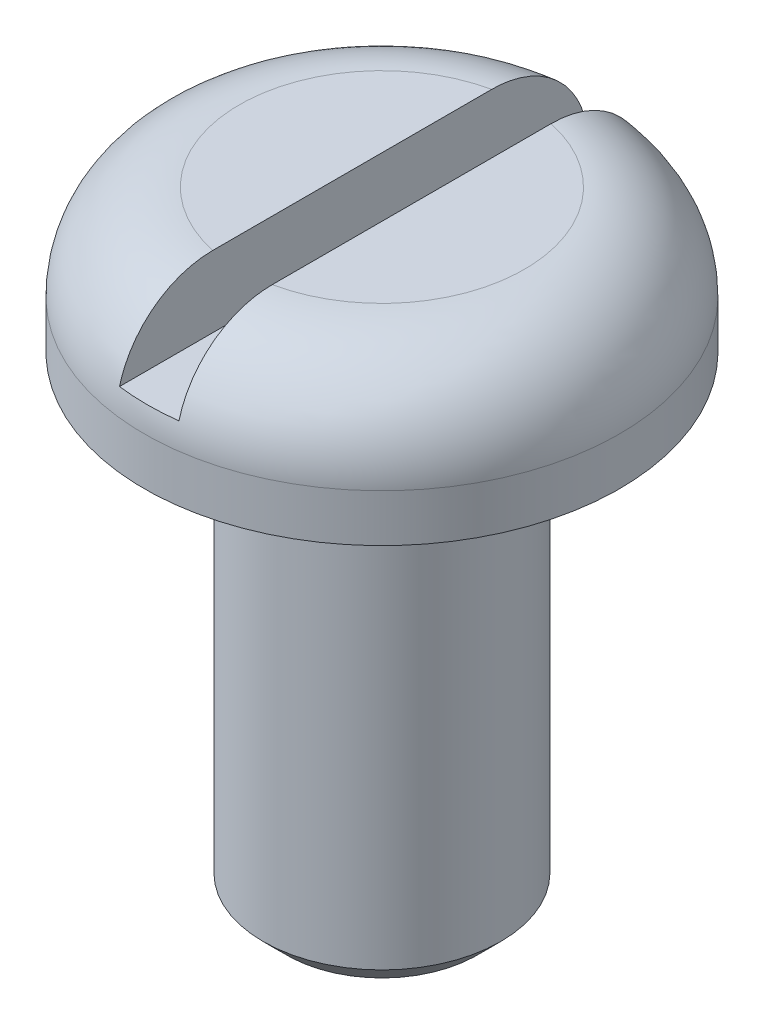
from build123d import *

# Parameters (mm, degrees)
SKETCH2_W           = 0.5
SKETCH2_H           = 5.813461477
CUT_EXTRUDE1_DEPTH  = 0.6
SKETCH3_R           = 1
BOSS_EXTRUDE1_DEPTH = 4
SKETCH4_OUTSIDE_W   = 15.536
SKETCH4_OUTSIDE_H   = 15.536
SKETCH4_OUTSIDE_R   = 0.8
CUT_EXTRUDE2_DEPTH  = 4
CUT_EXTRUDE2_DRAFT  = -45


with BuildPart() as part:
    # Sketch1 → Revolve1 (revolve)
    with BuildSketch(Plane.XY, mode=Mode.PRIVATE) as revolve1_sk:
        with BuildLine():
            Line((0, 0), (0, 1.2))
            Line((0, 1.2), (1.2, 1.2))
            ThreePointArc((1.2, 1.2), (1.765685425, 0.965685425), (2, 0.4))
            Line((2, 0.4), (2, 0))
            Line((2, 0), (0, 0))
        make_face()
    revolve(revolve1_sk.sketch.rotate(Axis((0, 0, 0), (0, 1, 0)), 90), axis=Axis((0, 0, 0), (0, 1, 0)))

    # Sketch2 → Cut-Extrude1 (cut)
    with BuildSketch(Plane(origin=(0, 1.2, 0), x_dir=(1, 0, 0), z_dir=(0, 1, 0))):
        with Locations((0, 0.020232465)):
            Rectangle(SKETCH2_W, SKETCH2_H)
    extrude(amount=-CUT_EXTRUDE1_DEPTH, mode=Mode.SUBTRACT)

    # Sketch3 → Boss-Extrude1 (add)
    with BuildSketch(Plane.XZ):
        with Locations(Location((0, 0, 0), (0, 0, 270))):
            Circle(SKETCH3_R)
    extrude(amount=BOSS_EXTRUDE1_DEPTH)


with BuildPart() as cut_extrude2_tool:
    # Sketch4 outside → Cut-Extrude2 (with draft: the straight prism first)
    with BuildSketch(Plane.XZ.offset(4)):
        Rectangle(SKETCH4_OUTSIDE_W, SKETCH4_OUTSIDE_H)
        Circle(SKETCH4_OUTSIDE_R, mode=Mode.SUBTRACT)
    extrude(amount=-CUT_EXTRUDE2_DEPTH)
    # Cut-Extrude2: the draft: its side faces are tilted about the plane it starts from
    cut_extrude2_sides = [cut_extrude2_tool.faces().sort_by_distance(p)[0] for p in [
        (0, -2, -7.768),
        (7.768, -2, 0),
        (0, -2, 7.768),
        (-7.768, -2, 0),
        (-0.8, -2, 0),
    ]]
    draft(cut_extrude2_sides, Plane.XZ.offset(4), CUT_EXTRUDE2_DRAFT)


with BuildPart() as part_1:
    add(part.part)

    # Cut-Extrude2: cut by cut_extrude2_tool
    add(cut_extrude2_tool.part, mode=Mode.SUBTRACT)


solid = part_1.part
